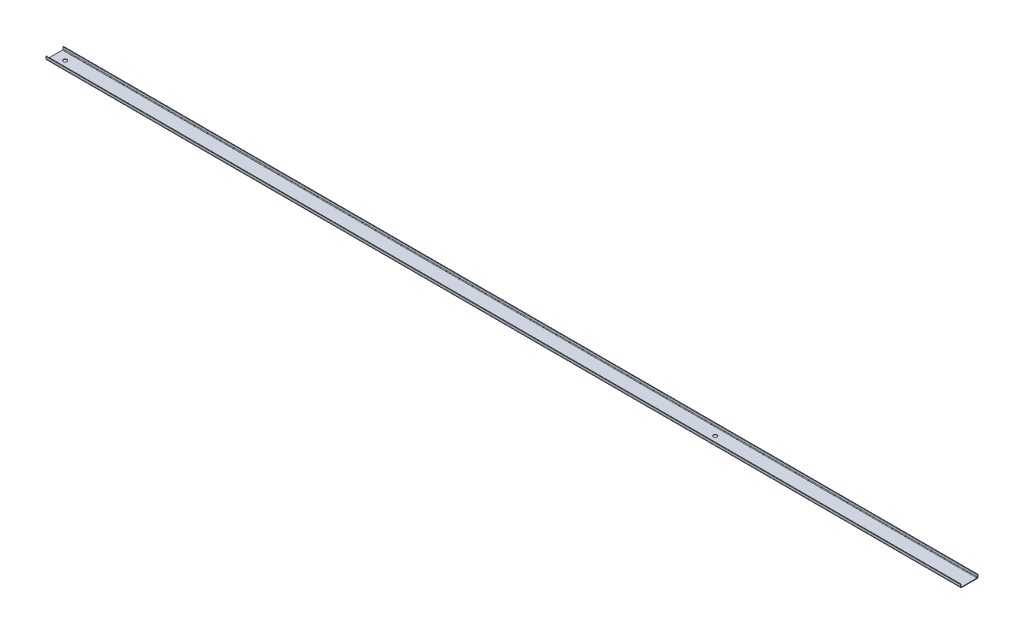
ISO-10303-21;
HEADER;
FILE_DESCRIPTION(('STEP AP214'),'2;1');
FILE_NAME('part.step','',(''),(''),'','','');
FILE_SCHEMA(('AUTOMOTIVE_DESIGN { 1 0 10303 214 1 1 1 1 }'));
ENDSEC;
DATA;
#1=APPLICATION_CONTEXT('core data for automotive mechanical design processes');
#2=APPLICATION_PROTOCOL_DEFINITION('international standard','automotive_design',2000,#1);
#3=PRODUCT_CONTEXT('',#1,'mechanical');
#4=PRODUCT('Part','Part','',(#3));
#5=PRODUCT_RELATED_PRODUCT_CATEGORY('part','',(#4));
#6=PRODUCT_DEFINITION_FORMATION('','',#4);
#7=PRODUCT_DEFINITION_CONTEXT('part definition',#1,'design');
#8=PRODUCT_DEFINITION('design','',#6,#7);
#9=PRODUCT_DEFINITION_SHAPE('','',#8);
#10=(LENGTH_UNIT() NAMED_UNIT(*) SI_UNIT(.MILLI.,.METRE.));
#11=(NAMED_UNIT(*) PLANE_ANGLE_UNIT() SI_UNIT($,.RADIAN.));
#12=(NAMED_UNIT(*) SI_UNIT($,.STERADIAN.) SOLID_ANGLE_UNIT());
#13=UNCERTAINTY_MEASURE_WITH_UNIT(LENGTH_MEASURE(1.E-05),#10,'distance_accuracy_value','');
#14=(GEOMETRIC_REPRESENTATION_CONTEXT(3) GLOBAL_UNCERTAINTY_ASSIGNED_CONTEXT((#13)) GLOBAL_UNIT_ASSIGNED_CONTEXT((#10,
#11,#12)) REPRESENTATION_CONTEXT('',''));
#15=CARTESIAN_POINT('',(0.,0.,0.));
#16=DIRECTION('',(0.,0.,1.));
#17=DIRECTION('',(1.,0.,0.));
#18=AXIS2_PLACEMENT_3D('',#15,#16,#17);
#19=CARTESIAN_POINT('',(838.75,2.,16.));
#20=DIRECTION('',(1.,0.,0.));
#21=DIRECTION('',(0.,0.,-1.));
#22=AXIS2_PLACEMENT_3D('',#19,#20,#21);
#23=PLANE('',#22);
#24=DIRECTION('',(0.,0.,-1.));
#25=VECTOR('',#24,1.);
#26=CARTESIAN_POINT('',(838.75,2.,16.));
#27=LINE('',#26,#25);
#28=CARTESIAN_POINT('',(838.75,2.,16.));
#29=VERTEX_POINT('',#28);
#30=CARTESIAN_POINT('',(838.75,2.,15.));
#31=VERTEX_POINT('',#30);
#32=EDGE_CURVE('E11',#29,#31,#27,.T.);
#33=ORIENTED_EDGE('',*,*,#32,.F.);
#34=CARTESIAN_POINT('',(838.75,2.,14.));
#35=DIRECTION('',(-1.,0.,0.));
#36=DIRECTION('',(0.,0.,1.));
#37=AXIS2_PLACEMENT_3D('',#34,#35,#36);
#38=CIRCLE('',#37,2.);
#39=CARTESIAN_POINT('',(838.75,0.,14.));
#40=VERTEX_POINT('',#39);
#41=EDGE_CURVE('E231',#29,#40,#38,.F.);
#42=ORIENTED_EDGE('',*,*,#41,.T.);
#43=DIRECTION('',(0.,-1.,0.));
#44=VECTOR('',#43,1.);
#45=CARTESIAN_POINT('',(838.75,1.,14.));
#46=LINE('',#45,#44);
#47=CARTESIAN_POINT('',(838.75,1.,14.));
#48=VERTEX_POINT('',#47);
#49=EDGE_CURVE('E46',#48,#40,#46,.T.);
#50=ORIENTED_EDGE('',*,*,#49,.F.);
#51=CARTESIAN_POINT('',(838.75,2.,14.));
#52=DIRECTION('',(1.,0.,0.));
#53=DIRECTION('',(0.,0.,-1.));
#54=AXIS2_PLACEMENT_3D('',#51,#52,#53);
#55=CIRCLE('',#54,1.);
#56=EDGE_CURVE('E215',#31,#48,#55,.T.);
#57=ORIENTED_EDGE('',*,*,#56,.F.);
#58=EDGE_LOOP('',(#33,#42,#50,#57));
#59=FACE_BOUND('',#58,.T.);
#60=ADVANCED_FACE('F38',(#59),#23,.T.);
#61=CARTESIAN_POINT('',(838.75,1.,14.));
#62=DIRECTION('',(1.,0.,0.));
#63=DIRECTION('',(0.,0.,-1.));
#64=AXIS2_PLACEMENT_3D('',#61,#62,#63);
#65=PLANE('',#64);
#66=DIRECTION('',(0.,-1.,0.));
#67=VECTOR('',#66,1.);
#68=CARTESIAN_POINT('',(838.75,6.,16.));
#69=LINE('',#68,#67);
#70=CARTESIAN_POINT('',(838.75,6.,16.));
#71=VERTEX_POINT('',#70);
#72=EDGE_CURVE('E227',#71,#29,#69,.T.);
#73=ORIENTED_EDGE('',*,*,#72,.T.);
#74=ORIENTED_EDGE('',*,*,#32,.T.);
#75=DIRECTION('',(0.,1.,0.));
#76=VECTOR('',#75,1.);
#77=CARTESIAN_POINT('',(838.75,6.,15.));
#78=LINE('',#77,#76);
#79=CARTESIAN_POINT('',(838.75,6.,15.));
#80=VERTEX_POINT('',#79);
#81=EDGE_CURVE('E219',#80,#31,#78,.F.);
#82=ORIENTED_EDGE('',*,*,#81,.F.);
#83=DIRECTION('',(0.,0.,-1.));
#84=VECTOR('',#83,1.);
#85=CARTESIAN_POINT('',(838.75,6.,16.));
#86=LINE('',#85,#84);
#87=EDGE_CURVE('E223',#71,#80,#86,.T.);
#88=ORIENTED_EDGE('',*,*,#87,.F.);
#89=EDGE_LOOP('',(#73,#74,#82,#88));
#90=FACE_BOUND('',#89,.T.);
#91=ADVANCED_FACE('F334',(#90),#65,.T.);
#92=CARTESIAN_POINT('',(-838.75,0.,14.));
#93=DIRECTION('',(-1.,0.,0.));
#94=DIRECTION('',(0.,0.,1.));
#95=AXIS2_PLACEMENT_3D('',#92,#93,#94);
#96=PLANE('',#95);
#97=DIRECTION('',(0.,1.,0.));
#98=VECTOR('',#97,1.);
#99=CARTESIAN_POINT('',(-838.75,0.,14.));
#100=LINE('',#99,#98);
#101=CARTESIAN_POINT('',(-838.75,0.,14.));
#102=VERTEX_POINT('',#101);
#103=CARTESIAN_POINT('',(-838.75,1.,14.));
#104=VERTEX_POINT('',#103);
#105=EDGE_CURVE('E289',#102,#104,#100,.T.);
#106=ORIENTED_EDGE('',*,*,#105,.F.);
#107=CARTESIAN_POINT('',(-838.75,2.,14.));
#108=DIRECTION('',(-1.,0.,0.));
#109=DIRECTION('',(0.,0.,1.));
#110=AXIS2_PLACEMENT_3D('',#107,#108,#109);
#111=CIRCLE('',#110,2.);
#112=CARTESIAN_POINT('',(-838.75,2.,16.));
#113=VERTEX_POINT('',#112);
#114=EDGE_CURVE('E186',#113,#102,#111,.F.);
#115=ORIENTED_EDGE('',*,*,#114,.F.);
#116=DIRECTION('',(0.,0.,1.));
#117=VECTOR('',#116,1.);
#118=CARTESIAN_POINT('',(-838.75,2.,15.));
#119=LINE('',#118,#117);
#120=CARTESIAN_POINT('',(-838.75,2.,15.));
#121=VERTEX_POINT('',#120);
#122=EDGE_CURVE('E286',#121,#113,#119,.T.);
#123=ORIENTED_EDGE('',*,*,#122,.F.);
#124=CARTESIAN_POINT('',(-838.75,2.,14.));
#125=DIRECTION('',(1.,0.,0.));
#126=DIRECTION('',(0.,0.,-1.));
#127=AXIS2_PLACEMENT_3D('',#124,#125,#126);
#128=CIRCLE('',#127,1.);
#129=EDGE_CURVE('E170',#121,#104,#128,.T.);
#130=ORIENTED_EDGE('',*,*,#129,.T.);
#131=EDGE_LOOP('',(#106,#115,#123,#130));
#132=FACE_BOUND('',#131,.T.);
#133=ADVANCED_FACE('F344',(#132),#96,.T.);
#134=CARTESIAN_POINT('',(-838.75,2.,15.));
#135=DIRECTION('',(-1.,0.,0.));
#136=DIRECTION('',(0.,0.,1.));
#137=AXIS2_PLACEMENT_3D('',#134,#135,#136);
#138=PLANE('',#137);
#139=DIRECTION('',(0.,0.,-1.));
#140=VECTOR('',#139,1.);
#141=CARTESIAN_POINT('',(-838.75,0.,16.));
#142=LINE('',#141,#140);
#143=CARTESIAN_POINT('',(-838.75,0.,-14.));
#144=VERTEX_POINT('',#143);
#145=EDGE_CURVE('E190',#102,#144,#142,.T.);
#146=ORIENTED_EDGE('',*,*,#145,.F.);
#147=ORIENTED_EDGE('',*,*,#105,.T.);
#148=DIRECTION('',(0.,0.,-1.));
#149=VECTOR('',#148,1.);
#150=CARTESIAN_POINT('',(-838.75,1.,16.));
#151=LINE('',#150,#149);
#152=CARTESIAN_POINT('',(-838.75,1.00000000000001,-14.));
#153=VERTEX_POINT('',#152);
#154=EDGE_CURVE('E166',#104,#153,#151,.T.);
#155=ORIENTED_EDGE('',*,*,#154,.T.);
#156=DIRECTION('',(0.,-1.,0.));
#157=VECTOR('',#156,1.);
#158=CARTESIAN_POINT('',(-838.75,1.00000000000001,-14.));
#159=LINE('',#158,#157);
#160=EDGE_CURVE('E138',#153,#144,#159,.T.);
#161=ORIENTED_EDGE('',*,*,#160,.T.);
#162=EDGE_LOOP('',(#146,#147,#155,#161));
#163=FACE_BOUND('',#162,.T.);
#164=ADVANCED_FACE('F346',(#163),#138,.T.);
#165=CARTESIAN_POINT('',(838.75,0.,-14.));
#166=DIRECTION('',(1.,0.,0.));
#167=DIRECTION('',(0.,0.,-1.));
#168=AXIS2_PLACEMENT_3D('',#165,#166,#167);
#169=PLANE('',#168);
#170=DIRECTION('',(0.,1.,0.));
#171=VECTOR('',#170,1.);
#172=CARTESIAN_POINT('',(838.75,0.,-14.));
#173=LINE('',#172,#171);
#174=CARTESIAN_POINT('',(838.75,0.,-14.));
#175=VERTEX_POINT('',#174);
#176=CARTESIAN_POINT('',(838.75,1.00000000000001,-14.));
#177=VERTEX_POINT('',#176);
#178=EDGE_CURVE('E60',#175,#177,#173,.T.);
#179=ORIENTED_EDGE('',*,*,#178,.F.);
#180=CARTESIAN_POINT('',(838.75,2.00000000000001,-14.));
#181=DIRECTION('',(-1.,0.,0.));
#182=DIRECTION('',(0.,0.,1.));
#183=AXIS2_PLACEMENT_3D('',#180,#181,#182);
#184=CIRCLE('',#183,2.);
#185=CARTESIAN_POINT('',(838.75,2.00000000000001,-16.));
#186=VERTEX_POINT('',#185);
#187=EDGE_CURVE('E238',#175,#186,#184,.F.);
#188=ORIENTED_EDGE('',*,*,#187,.T.);
#189=DIRECTION('',(0.,0.,-1.));
#190=VECTOR('',#189,1.);
#191=CARTESIAN_POINT('',(838.75,2.00000000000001,-15.));
#192=LINE('',#191,#190);
#193=CARTESIAN_POINT('',(838.75,2.00000000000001,-15.));
#194=VERTEX_POINT('',#193);
#195=EDGE_CURVE('E53',#194,#186,#192,.T.);
#196=ORIENTED_EDGE('',*,*,#195,.F.);
#197=CARTESIAN_POINT('',(838.75,2.00000000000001,-14.));
#198=DIRECTION('',(1.,0.,0.));
#199=DIRECTION('',(0.,0.,-1.));
#200=AXIS2_PLACEMENT_3D('',#197,#198,#199);
#201=CIRCLE('',#200,1.);
#202=EDGE_CURVE('E207',#177,#194,#201,.T.);
#203=ORIENTED_EDGE('',*,*,#202,.F.);
#204=EDGE_LOOP('',(#179,#188,#196,#203));
#205=FACE_BOUND('',#204,.T.);
#206=ADVANCED_FACE('F312',(#205),#169,.T.);
#207=CARTESIAN_POINT('',(838.75,2.00000000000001,-15.));
#208=DIRECTION('',(1.,0.,0.));
#209=DIRECTION('',(0.,0.,-1.));
#210=AXIS2_PLACEMENT_3D('',#207,#208,#209);
#211=PLANE('',#210);
#212=DIRECTION('',(0.,0.,-1.));
#213=VECTOR('',#212,1.);
#214=CARTESIAN_POINT('',(838.75,0.,16.));
#215=LINE('',#214,#213);
#216=EDGE_CURVE('E235',#40,#175,#215,.T.);
#217=ORIENTED_EDGE('',*,*,#216,.T.);
#218=ORIENTED_EDGE('',*,*,#178,.T.);
#219=DIRECTION('',(0.,0.,-1.));
#220=VECTOR('',#219,1.);
#221=CARTESIAN_POINT('',(838.75,1.,16.));
#222=LINE('',#221,#220);
#223=EDGE_CURVE('E211',#48,#177,#222,.T.);
#224=ORIENTED_EDGE('',*,*,#223,.F.);
#225=ORIENTED_EDGE('',*,*,#49,.T.);
#226=EDGE_LOOP('',(#217,#218,#224,#225));
#227=FACE_BOUND('',#226,.T.);
#228=ADVANCED_FACE('F294',(#227),#211,.T.);
#229=CARTESIAN_POINT('',(-838.75,2.00000000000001,-16.));
#230=DIRECTION('',(-1.,0.,0.));
#231=DIRECTION('',(0.,0.,1.));
#232=AXIS2_PLACEMENT_3D('',#229,#230,#231);
#233=PLANE('',#232);
#234=DIRECTION('',(0.,0.,1.));
#235=VECTOR('',#234,1.);
#236=CARTESIAN_POINT('',(-838.75,2.00000000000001,-16.));
#237=LINE('',#236,#235);
#238=CARTESIAN_POINT('',(-838.75,2.00000000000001,-16.));
#239=VERTEX_POINT('',#238);
#240=CARTESIAN_POINT('',(-838.75,2.00000000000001,-15.));
#241=VERTEX_POINT('',#240);
#242=EDGE_CURVE('E279',#239,#241,#237,.T.);
#243=ORIENTED_EDGE('',*,*,#242,.F.);
#244=CARTESIAN_POINT('',(-838.75,2.00000000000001,-14.));
#245=DIRECTION('',(-1.,0.,0.));
#246=DIRECTION('',(0.,0.,1.));
#247=AXIS2_PLACEMENT_3D('',#244,#245,#246);
#248=CIRCLE('',#247,2.);
#249=EDGE_CURVE('E194',#144,#239,#248,.F.);
#250=ORIENTED_EDGE('',*,*,#249,.F.);
#251=ORIENTED_EDGE('',*,*,#160,.F.);
#252=CARTESIAN_POINT('',(-838.75,2.00000000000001,-14.));
#253=DIRECTION('',(1.,0.,0.));
#254=DIRECTION('',(0.,0.,-1.));
#255=AXIS2_PLACEMENT_3D('',#252,#253,#254);
#256=CIRCLE('',#255,1.);
#257=EDGE_CURVE('E159',#153,#241,#256,.T.);
#258=ORIENTED_EDGE('',*,*,#257,.T.);
#259=EDGE_LOOP('',(#243,#250,#251,#258));
#260=FACE_BOUND('',#259,.T.);
#261=ADVANCED_FACE('F348',(#260),#233,.T.);
#262=CARTESIAN_POINT('',(-838.75,1.00000000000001,-14.));
#263=DIRECTION('',(-1.,0.,0.));
#264=DIRECTION('',(0.,0.,1.));
#265=AXIS2_PLACEMENT_3D('',#262,#263,#264);
#266=PLANE('',#265);
#267=DIRECTION('',(0.,1.,0.));
#268=VECTOR('',#267,1.);
#269=CARTESIAN_POINT('',(-838.75,0.,-16.));
#270=LINE('',#269,#268);
#271=CARTESIAN_POINT('',(-838.75,6.00000000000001,-16.));
#272=VERTEX_POINT('',#271);
#273=EDGE_CURVE('E143',#239,#272,#270,.T.);
#274=ORIENTED_EDGE('',*,*,#273,.F.);
#275=ORIENTED_EDGE('',*,*,#242,.T.);
#276=DIRECTION('',(0.,1.,0.));
#277=VECTOR('',#276,1.);
#278=CARTESIAN_POINT('',(-838.75,0.,-15.));
#279=LINE('',#278,#277);
#280=CARTESIAN_POINT('',(-838.75,6.00000000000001,-15.));
#281=VERTEX_POINT('',#280);
#282=EDGE_CURVE('E153',#241,#281,#279,.T.);
#283=ORIENTED_EDGE('',*,*,#282,.T.);
#284=DIRECTION('',(0.,0.,-1.));
#285=VECTOR('',#284,1.);
#286=CARTESIAN_POINT('',(-838.75,6.00000000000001,-15.));
#287=LINE('',#286,#285);
#288=EDGE_CURVE('E131',#281,#272,#287,.T.);
#289=ORIENTED_EDGE('',*,*,#288,.T.);
#290=EDGE_LOOP('',(#274,#275,#283,#289));
#291=FACE_BOUND('',#290,.T.);
#292=ADVANCED_FACE('F151',(#291),#266,.T.);
#293=CARTESIAN_POINT('',(838.75,0.,-16.));
#294=DIRECTION('',(0.,0.,1.));
#295=DIRECTION('',(1.,0.,0.));
#296=AXIS2_PLACEMENT_3D('',#293,#294,#295);
#297=PLANE('',#296);
#298=ORIENTED_EDGE('',*,*,#273,.T.);
#299=DIRECTION('',(-1.,0.,0.));
#300=VECTOR('',#299,1.);
#301=CARTESIAN_POINT('',(838.75,6.00000000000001,-16.));
#302=LINE('',#301,#300);
#303=CARTESIAN_POINT('',(838.75,6.00000000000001,-16.));
#304=VERTEX_POINT('',#303);
#305=EDGE_CURVE('E127',#304,#272,#302,.T.);
#306=ORIENTED_EDGE('',*,*,#305,.F.);
#307=DIRECTION('',(0.,1.,0.));
#308=VECTOR('',#307,1.);
#309=CARTESIAN_POINT('',(838.75,0.,-16.));
#310=LINE('',#309,#308);
#311=EDGE_CURVE('E198',#186,#304,#310,.T.);
#312=ORIENTED_EDGE('',*,*,#311,.F.);
#313=DIRECTION('',(-1.,0.,0.));
#314=VECTOR('',#313,1.);
#315=CARTESIAN_POINT('',(838.75,2.00000000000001,-16.));
#316=LINE('',#315,#314);
#317=EDGE_CURVE('E146',#186,#239,#316,.T.);
#318=ORIENTED_EDGE('',*,*,#317,.T.);
#319=EDGE_LOOP('',(#298,#306,#312,#318));
#320=FACE_BOUND('',#319,.T.);
#321=ADVANCED_FACE('F144',(#320),#297,.F.);
#322=CARTESIAN_POINT('',(838.75,6.00000000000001,-15.));
#323=DIRECTION('',(0.,1.,0.));
#324=DIRECTION('',(0.,0.,1.));
#325=AXIS2_PLACEMENT_3D('',#322,#323,#324);
#326=PLANE('',#325);
#327=ORIENTED_EDGE('',*,*,#288,.F.);
#328=DIRECTION('',(-1.,0.,0.));
#329=VECTOR('',#328,1.);
#330=CARTESIAN_POINT('',(838.75,6.00000000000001,-15.));
#331=LINE('',#330,#329);
#332=CARTESIAN_POINT('',(838.75,6.00000000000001,-15.));
#333=VERTEX_POINT('',#332);
#334=EDGE_CURVE('E139',#333,#281,#331,.T.);
#335=ORIENTED_EDGE('',*,*,#334,.F.);
#336=DIRECTION('',(0.,0.,-1.));
#337=VECTOR('',#336,1.);
#338=CARTESIAN_POINT('',(838.75,6.00000000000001,-15.));
#339=LINE('',#338,#337);
#340=EDGE_CURVE('E134',#333,#304,#339,.T.);
#341=ORIENTED_EDGE('',*,*,#340,.T.);
#342=ORIENTED_EDGE('',*,*,#305,.T.);
#343=EDGE_LOOP('',(#327,#335,#341,#342));
#344=FACE_BOUND('',#343,.T.);
#345=ADVANCED_FACE('F129',(#344),#326,.T.);
#346=CARTESIAN_POINT('',(838.75,0.,-15.));
#347=DIRECTION('',(0.,0.,1.));
#348=DIRECTION('',(1.,0.,0.));
#349=AXIS2_PLACEMENT_3D('',#346,#347,#348);
#350=PLANE('',#349);
#351=ORIENTED_EDGE('',*,*,#282,.F.);
#352=DIRECTION('',(-1.,0.,0.));
#353=VECTOR('',#352,1.);
#354=CARTESIAN_POINT('',(838.75,2.00000000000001,-15.));
#355=LINE('',#354,#353);
#356=EDGE_CURVE('E271',#194,#241,#355,.T.);
#357=ORIENTED_EDGE('',*,*,#356,.F.);
#358=DIRECTION('',(0.,1.,0.));
#359=VECTOR('',#358,1.);
#360=CARTESIAN_POINT('',(838.75,0.,-15.));
#361=LINE('',#360,#359);
#362=EDGE_CURVE('E203',#194,#333,#361,.T.);
#363=ORIENTED_EDGE('',*,*,#362,.T.);
#364=ORIENTED_EDGE('',*,*,#334,.T.);
#365=EDGE_LOOP('',(#351,#357,#363,#364));
#366=FACE_BOUND('',#365,.T.);
#367=ADVANCED_FACE('F315',(#366),#350,.T.);
#368=CARTESIAN_POINT('',(838.75,2.00000000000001,-14.));
#369=DIRECTION('',(-1.,0.,0.));
#370=DIRECTION('',(0.,0.,1.));
#371=AXIS2_PLACEMENT_3D('',#368,#369,#370);
#372=CYLINDRICAL_SURFACE('',#371,1.);
#373=ORIENTED_EDGE('',*,*,#257,.F.);
#374=DIRECTION('',(-1.,0.,0.));
#375=VECTOR('',#374,1.);
#376=CARTESIAN_POINT('',(838.75,1.00000000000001,-14.));
#377=LINE('',#376,#375);
#378=EDGE_CURVE('E268',#177,#153,#377,.T.);
#379=ORIENTED_EDGE('',*,*,#378,.F.);
#380=ORIENTED_EDGE('',*,*,#202,.T.);
#381=ORIENTED_EDGE('',*,*,#356,.T.);
#382=EDGE_LOOP('',(#373,#379,#380,#381));
#383=FACE_BOUND('',#382,.T.);
#384=ADVANCED_FACE('F320',(#383),#372,.F.);
#385=CARTESIAN_POINT('',(838.75,1.,16.));
#386=DIRECTION('',(0.,1.,0.));
#387=DIRECTION('',(0.,0.,1.));
#388=AXIS2_PLACEMENT_3D('',#385,#386,#387);
#389=PLANE('',#388);
#390=CARTESIAN_POINT('',(-819.75,1.,0.));
#391=DIRECTION('',(0.,1.,0.));
#392=DIRECTION('',(0.,0.,1.));
#393=AXIS2_PLACEMENT_3D('',#390,#391,#392);
#394=CIRCLE('',#393,3.39999999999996);
#395=CARTESIAN_POINT('',(-819.75,1.,3.39999999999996));
#396=VERTEX_POINT('',#395);
#397=EDGE_CURVE('E621',#396,#396,#394,.T.);
#398=ORIENTED_EDGE('',*,*,#397,.F.);
#399=EDGE_LOOP('',(#398));
#400=FACE_BOUND('',#399,.T.);
#401=CARTESIAN_POINT('',(372.75,1.,0.));
#402=DIRECTION('',(0.,1.,0.));
#403=DIRECTION('',(0.,0.,1.));
#404=AXIS2_PLACEMENT_3D('',#401,#402,#403);
#405=CIRCLE('',#404,3.40000000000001);
#406=CARTESIAN_POINT('',(372.75,1.,3.40000000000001));
#407=VERTEX_POINT('',#406);
#408=EDGE_CURVE('E149',#407,#407,#405,.T.);
#409=ORIENTED_EDGE('',*,*,#408,.F.);
#410=EDGE_LOOP('',(#409));
#411=FACE_BOUND('',#410,.T.);
#412=ORIENTED_EDGE('',*,*,#154,.F.);
#413=DIRECTION('',(-1.,0.,0.));
#414=VECTOR('',#413,1.);
#415=CARTESIAN_POINT('',(838.75,1.,14.));
#416=LINE('',#415,#414);
#417=EDGE_CURVE('E264',#48,#104,#416,.T.);
#418=ORIENTED_EDGE('',*,*,#417,.F.);
#419=ORIENTED_EDGE('',*,*,#223,.T.);
#420=ORIENTED_EDGE('',*,*,#378,.T.);
#421=EDGE_LOOP('',(#412,#418,#419,#420));
#422=FACE_BOUND('',#421,.T.);
#423=ADVANCED_FACE('F323',(#400,#411,#422),#389,.T.);
#424=CARTESIAN_POINT('',(838.75,2.,14.));
#425=DIRECTION('',(-1.,0.,0.));
#426=DIRECTION('',(0.,0.,1.));
#427=AXIS2_PLACEMENT_3D('',#424,#425,#426);
#428=CYLINDRICAL_SURFACE('',#427,1.);
#429=ORIENTED_EDGE('',*,*,#129,.F.);
#430=DIRECTION('',(-1.,0.,0.));
#431=VECTOR('',#430,1.);
#432=CARTESIAN_POINT('',(838.75,2.,15.));
#433=LINE('',#432,#431);
#434=EDGE_CURVE('E260',#31,#121,#433,.T.);
#435=ORIENTED_EDGE('',*,*,#434,.F.);
#436=ORIENTED_EDGE('',*,*,#56,.T.);
#437=ORIENTED_EDGE('',*,*,#417,.T.);
#438=EDGE_LOOP('',(#429,#435,#436,#437));
#439=FACE_BOUND('',#438,.T.);
#440=ADVANCED_FACE('F326',(#439),#428,.F.);
#441=CARTESIAN_POINT('',(838.75,6.,15.));
#442=DIRECTION('',(0.,0.,-1.));
#443=DIRECTION('',(-1.,0.,0.));
#444=AXIS2_PLACEMENT_3D('',#441,#442,#443);
#445=PLANE('',#444);
#446=DIRECTION('',(0.,1.,0.));
#447=VECTOR('',#446,1.);
#448=CARTESIAN_POINT('',(-838.75,6.,15.));
#449=LINE('',#448,#447);
#450=CARTESIAN_POINT('',(-838.75,6.,15.));
#451=VERTEX_POINT('',#450);
#452=EDGE_CURVE('E174',#451,#121,#449,.F.);
#453=ORIENTED_EDGE('',*,*,#452,.F.);
#454=DIRECTION('',(-1.,0.,0.));
#455=VECTOR('',#454,1.);
#456=CARTESIAN_POINT('',(838.75,6.,15.));
#457=LINE('',#456,#455);
#458=EDGE_CURVE('E257',#80,#451,#457,.T.);
#459=ORIENTED_EDGE('',*,*,#458,.F.);
#460=ORIENTED_EDGE('',*,*,#81,.T.);
#461=ORIENTED_EDGE('',*,*,#434,.T.);
#462=EDGE_LOOP('',(#453,#459,#460,#461));
#463=FACE_BOUND('',#462,.T.);
#464=ADVANCED_FACE('F331',(#463),#445,.T.);
#465=CARTESIAN_POINT('',(838.75,6.,16.));
#466=DIRECTION('',(0.,1.,0.));
#467=DIRECTION('',(0.,0.,1.));
#468=AXIS2_PLACEMENT_3D('',#465,#466,#467);
#469=PLANE('',#468);
#470=DIRECTION('',(0.,0.,-1.));
#471=VECTOR('',#470,1.);
#472=CARTESIAN_POINT('',(-838.75,6.,16.));
#473=LINE('',#472,#471);
#474=CARTESIAN_POINT('',(-838.75,6.,16.));
#475=VERTEX_POINT('',#474);
#476=EDGE_CURVE('E178',#475,#451,#473,.T.);
#477=ORIENTED_EDGE('',*,*,#476,.F.);
#478=DIRECTION('',(-1.,0.,0.));
#479=VECTOR('',#478,1.);
#480=CARTESIAN_POINT('',(838.75,6.,16.));
#481=LINE('',#480,#479);
#482=EDGE_CURVE('E254',#71,#475,#481,.T.);
#483=ORIENTED_EDGE('',*,*,#482,.F.);
#484=ORIENTED_EDGE('',*,*,#87,.T.);
#485=ORIENTED_EDGE('',*,*,#458,.T.);
#486=EDGE_LOOP('',(#477,#483,#484,#485));
#487=FACE_BOUND('',#486,.T.);
#488=ADVANCED_FACE('F337',(#487),#469,.T.);
#489=CARTESIAN_POINT('',(838.75,6.,16.));
#490=DIRECTION('',(0.,0.,-1.));
#491=DIRECTION('',(-1.,0.,0.));
#492=AXIS2_PLACEMENT_3D('',#489,#490,#491);
#493=PLANE('',#492);
#494=DIRECTION('',(0.,-1.,0.));
#495=VECTOR('',#494,1.);
#496=CARTESIAN_POINT('',(-838.75,6.,16.));
#497=LINE('',#496,#495);
#498=EDGE_CURVE('E182',#475,#113,#497,.T.);
#499=ORIENTED_EDGE('',*,*,#498,.T.);
#500=DIRECTION('',(-1.,0.,0.));
#501=VECTOR('',#500,1.);
#502=CARTESIAN_POINT('',(838.75,2.,16.));
#503=LINE('',#502,#501);
#504=EDGE_CURVE('E250',#29,#113,#503,.T.);
#505=ORIENTED_EDGE('',*,*,#504,.F.);
#506=ORIENTED_EDGE('',*,*,#72,.F.);
#507=ORIENTED_EDGE('',*,*,#482,.T.);
#508=EDGE_LOOP('',(#499,#505,#506,#507));
#509=FACE_BOUND('',#508,.T.);
#510=ADVANCED_FACE('F342',(#509),#493,.F.);
#511=CARTESIAN_POINT('',(838.75,2.,14.));
#512=DIRECTION('',(-1.,0.,0.));
#513=DIRECTION('',(0.,0.,1.));
#514=AXIS2_PLACEMENT_3D('',#511,#512,#513);
#515=CYLINDRICAL_SURFACE('',#514,2.);
#516=ORIENTED_EDGE('',*,*,#114,.T.);
#517=DIRECTION('',(-1.,0.,0.));
#518=VECTOR('',#517,1.);
#519=CARTESIAN_POINT('',(838.75,0.,14.));
#520=LINE('',#519,#518);
#521=EDGE_CURVE('E246',#40,#102,#520,.T.);
#522=ORIENTED_EDGE('',*,*,#521,.F.);
#523=ORIENTED_EDGE('',*,*,#41,.F.);
#524=ORIENTED_EDGE('',*,*,#504,.T.);
#525=EDGE_LOOP('',(#516,#522,#523,#524));
#526=FACE_BOUND('',#525,.T.);
#527=ADVANCED_FACE('F303',(#526),#515,.T.);
#528=CARTESIAN_POINT('',(838.75,0.,16.));
#529=DIRECTION('',(0.,1.,0.));
#530=DIRECTION('',(0.,0.,1.));
#531=AXIS2_PLACEMENT_3D('',#528,#529,#530);
#532=PLANE('',#531);
#533=CARTESIAN_POINT('',(-819.75,0.,0.));
#534=DIRECTION('',(0.,1.,0.));
#535=DIRECTION('',(0.,0.,1.));
#536=AXIS2_PLACEMENT_3D('',#533,#534,#535);
#537=CIRCLE('',#536,3.39999999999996);
#538=CARTESIAN_POINT('',(-819.75,0.,3.39999999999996));
#539=VERTEX_POINT('',#538);
#540=EDGE_CURVE('E618',#539,#539,#537,.T.);
#541=ORIENTED_EDGE('',*,*,#540,.T.);
#542=EDGE_LOOP('',(#541));
#543=FACE_BOUND('',#542,.T.);
#544=CARTESIAN_POINT('',(372.75,0.,0.));
#545=DIRECTION('',(0.,1.,0.));
#546=DIRECTION('',(0.,0.,1.));
#547=AXIS2_PLACEMENT_3D('',#544,#545,#546);
#548=CIRCLE('',#547,3.40000000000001);
#549=CARTESIAN_POINT('',(372.75,0.,3.40000000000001));
#550=VERTEX_POINT('',#549);
#551=EDGE_CURVE('E623',#550,#550,#548,.T.);
#552=ORIENTED_EDGE('',*,*,#551,.T.);
#553=EDGE_LOOP('',(#552));
#554=FACE_BOUND('',#553,.T.);
#555=ORIENTED_EDGE('',*,*,#145,.T.);
#556=DIRECTION('',(-1.,0.,0.));
#557=VECTOR('',#556,1.);
#558=CARTESIAN_POINT('',(838.75,0.,-14.));
#559=LINE('',#558,#557);
#560=EDGE_CURVE('E242',#175,#144,#559,.T.);
#561=ORIENTED_EDGE('',*,*,#560,.F.);
#562=ORIENTED_EDGE('',*,*,#216,.F.);
#563=ORIENTED_EDGE('',*,*,#521,.T.);
#564=EDGE_LOOP('',(#555,#561,#562,#563));
#565=FACE_BOUND('',#564,.T.);
#566=ADVANCED_FACE('F307',(#543,#554,#565),#532,.F.);
#567=CARTESIAN_POINT('',(838.75,2.00000000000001,-14.));
#568=DIRECTION('',(-1.,0.,0.));
#569=DIRECTION('',(0.,0.,1.));
#570=AXIS2_PLACEMENT_3D('',#567,#568,#569);
#571=CYLINDRICAL_SURFACE('',#570,2.);
#572=ORIENTED_EDGE('',*,*,#249,.T.);
#573=ORIENTED_EDGE('',*,*,#317,.F.);
#574=ORIENTED_EDGE('',*,*,#187,.F.);
#575=ORIENTED_EDGE('',*,*,#560,.T.);
#576=EDGE_LOOP('',(#572,#573,#574,#575));
#577=FACE_BOUND('',#576,.T.);
#578=ADVANCED_FACE('F311',(#577),#571,.T.);
#579=CARTESIAN_POINT('',(838.75,2.00000000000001,-14.));
#580=DIRECTION('',(1.,0.,0.));
#581=DIRECTION('',(0.,0.,-1.));
#582=AXIS2_PLACEMENT_3D('',#579,#580,#581);
#583=PLANE('',#582);
#584=ORIENTED_EDGE('',*,*,#311,.T.);
#585=ORIENTED_EDGE('',*,*,#340,.F.);
#586=ORIENTED_EDGE('',*,*,#362,.F.);
#587=ORIENTED_EDGE('',*,*,#195,.T.);
#588=EDGE_LOOP('',(#584,#585,#586,#587));
#589=FACE_BOUND('',#588,.T.);
#590=ADVANCED_FACE('F318',(#589),#583,.T.);
#591=CARTESIAN_POINT('',(-838.75,2.00000000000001,-14.));
#592=DIRECTION('',(1.,0.,0.));
#593=DIRECTION('',(0.,0.,-1.));
#594=AXIS2_PLACEMENT_3D('',#591,#592,#593);
#595=PLANE('',#594);
#596=ORIENTED_EDGE('',*,*,#452,.T.);
#597=ORIENTED_EDGE('',*,*,#122,.T.);
#598=ORIENTED_EDGE('',*,*,#498,.F.);
#599=ORIENTED_EDGE('',*,*,#476,.T.);
#600=EDGE_LOOP('',(#596,#597,#598,#599));
#601=FACE_BOUND('',#600,.T.);
#602=ADVANCED_FACE('F479',(#601),#595,.F.);
#603=CARTESIAN_POINT('',(372.75,1.,0.));
#604=DIRECTION('',(0.,1.,0.));
#605=DIRECTION('',(0.,0.,1.));
#606=AXIS2_PLACEMENT_3D('',#603,#604,#605);
#607=CYLINDRICAL_SURFACE('',#606,3.40000000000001);
#608=ORIENTED_EDGE('',*,*,#551,.F.);
#609=EDGE_LOOP('',(#608));
#610=FACE_BOUND('',#609,.T.);
#611=ORIENTED_EDGE('',*,*,#408,.T.);
#612=EDGE_LOOP('',(#611));
#613=FACE_BOUND('',#612,.T.);
#614=ADVANCED_FACE('F486',(#610,#613),#607,.F.);
#615=CARTESIAN_POINT('',(-819.75,1.,0.));
#616=DIRECTION('',(0.,1.,0.));
#617=DIRECTION('',(0.,0.,1.));
#618=AXIS2_PLACEMENT_3D('',#615,#616,#617);
#619=CYLINDRICAL_SURFACE('',#618,3.39999999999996);
#620=ORIENTED_EDGE('',*,*,#540,.F.);
#621=EDGE_LOOP('',(#620));
#622=FACE_BOUND('',#621,.T.);
#623=ORIENTED_EDGE('',*,*,#397,.T.);
#624=EDGE_LOOP('',(#623));
#625=FACE_BOUND('',#624,.T.);
#626=ADVANCED_FACE('F494',(#622,#625),#619,.F.);
#627=CLOSED_SHELL('',(#60,#91,#133,#164,#206,#228,#261,#292,#321,#345,#367,#384,#423,#440,#464,
#488,#510,#527,#566,#578,#590,#602,#614,#626));
#628=MANIFOLD_SOLID_BREP('B2',#627);
#629=ADVANCED_BREP_SHAPE_REPRESENTATION('',(#18,#628),#14);
#630=SHAPE_DEFINITION_REPRESENTATION(#9,#629);
ENDSEC;
END-ISO-10303-21;
